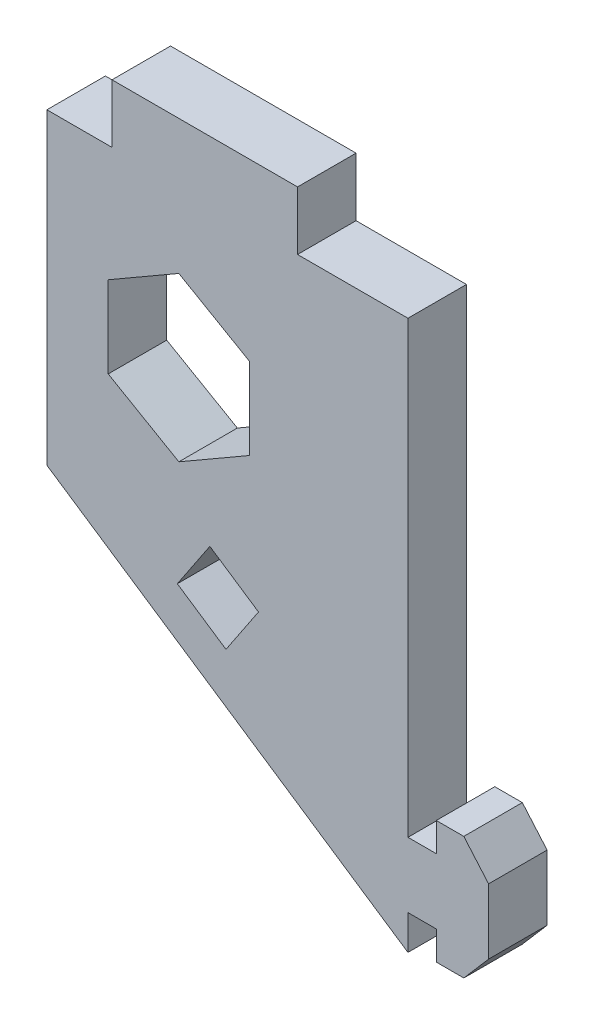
from build123d import *

# Parameters (mm, degrees)
BOSS_EXTRUDE1_DEPTH = 5.3848
SKETCH2_W           = 5.990247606
SKETCH2_H           = 5.3848
SKETCH2_W_2         = 10.16
CUT_EXTRUDE1_DEPTH  = 5.3848
CUT_EXTRUDE2_DEPTH  = 5.3848


with BuildPart() as part:
    # Sketch1 → Boss-Extrude1 (new body)
    with BuildSketch(Plane.XY):
        Polygon((-789.564115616, 345.575836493), (-789.564115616, 351.573777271), (-789.564115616, 351.910458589), (-789.564115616, 372.925155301), (-792.837828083, 372.925155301), (-822.787925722, 372.925155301), (-822.787925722, 339.210458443), (-789.564115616, 317.000836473), (-789.564115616, 320.175836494), (-786.957440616, 320.175836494), (-786.957440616, 317.531556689), (-784.424789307, 317.531556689), (-782.144655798, 320.175836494), (-782.144655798, 326.173777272), (-784.424789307, 328.818057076), (-786.957440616, 328.818057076), (-786.957440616, 326.173777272), (-789.564115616, 326.173777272), align=None)
        Polygon((-817.146115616, 356.815132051), (-810.646115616, 360.567908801), (-804.146115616, 356.815132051), (-804.146115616, 349.309578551), (-810.646115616, 345.556801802), (-817.146115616, 349.309578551), align=None, mode=Mode.SUBTRACT)
    extrude(amount=BOSS_EXTRUDE1_DEPTH)

    # Sketch2 → Cut-Extrude1 (cut)
    with BuildSketch(Plane.XY.offset(5.3848)):
        with Locations((-819.792801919, 370.232755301)):
            Rectangle(SKETCH2_W, SKETCH2_H)
        with Locations((-794.644115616, 370.232755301)):
            Rectangle(SKETCH2_W_2, SKETCH2_H)
    extrude(amount=-CUT_EXTRUDE1_DEPTH, mode=Mode.SUBTRACT)

    # Sketch3 → Cut-Extrude2 (cut)
    with BuildSketch(Plane.XY.offset(5.3848)):
        Polygon((-803.316586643, 337.254216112), (-806.309169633, 332.777552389), (-810.785833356, 335.770135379), (-807.793250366, 340.246799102), align=None)
    extrude(amount=-CUT_EXTRUDE2_DEPTH, mode=Mode.SUBTRACT)


solid = part.part
